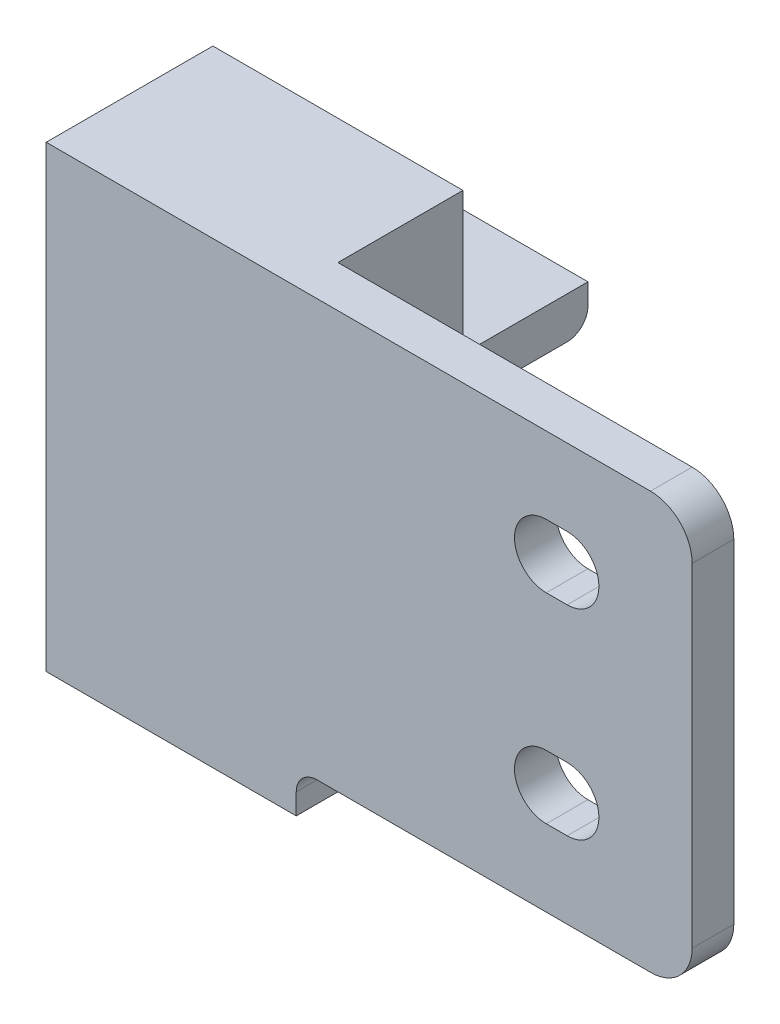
from build123d import *

# Parameters (mm, degrees)
ESQUISSE1_W             = 31
ESQUISSE1_H             = 20
BOSS_EXTRU_1_DEPTH      = 2
BOSS_EXTRU_2_DEPTH      = 6
CONG_2_R                = 2
BOSS_EXTRU_3_DEPTH      = 2
BOSS_EXTRU_3_DEPTH_BACK = 12
ESQUISSE5_W             = 12
ESQUISSE5_H             = 2
CONG_3_R                = 1


with BuildPart() as part:
    # Esquisse1 → Boss.-Extru.1 (new body)
    with BuildSketch(Plane.XY):
        with Locations((-15, 0)):
            Rectangle(ESQUISSE1_W, ESQUISSE1_H)
        with BuildLine():
            Line((-6.5, -3.275), (-5.5, -3.275))
            ThreePointArc((-5.5, -3.275), (-3.975, -4.8), (-5.5, -6.325))
            Line((-5.5, -6.325), (-6.5, -6.325))
            ThreePointArc((-6.5, -6.325), (-8.025, -4.8), (-6.5, -3.275))
        make_face(mode=Mode.SUBTRACT)
        with BuildLine():
            Line((-6.5, 6.325), (-5.5, 6.325))
            ThreePointArc((-5.5, 6.325), (-3.975, 4.8), (-5.5, 3.275))
            Line((-5.5, 3.275), (-6.5, 3.275))
            ThreePointArc((-6.5, 3.275), (-8.025, 4.8), (-6.5, 6.325))
        make_face(mode=Mode.SUBTRACT)
    extrude(amount=BOSS_EXTRU_1_DEPTH)

    # Esquisse3 → Boss.-Extru.2 (add)
    with BuildSketch(Plane.XY):
        Polygon((-30.5, 10), (-20.5, 10), (-18.5, 10), (-18.5, -10), (-20.5, -10), (-30.5, -10), align=None)
    extrude(amount=-BOSS_EXTRU_2_DEPTH)

    # Cong_2
    cong_2_edges = [part.edges().sort_by_distance(p)[0] for p in [
        (0.5, -10, 1),
        (0.5, 10, 1),
    ]]
    fillet(cong_2_edges, radius=CONG_2_R)

    # Esquisse5 → Boss.-Extru.3 (add, two sides: drawn at the far end of the back side and taken through both)
    with BuildSketch(Plane.XY.offset(-BOSS_EXTRU_3_DEPTH_BACK)):
        with Locations((-24.5, -11)):
            Rectangle(ESQUISSE5_W, ESQUISSE5_H)
        with Locations((-24.5, 2.2)):
            Rectangle(ESQUISSE5_W, ESQUISSE5_H)
    extrude(amount=BOSS_EXTRU_3_DEPTH + BOSS_EXTRU_3_DEPTH_BACK)

    # Cong_3
    cong_3_edges = [part.edges().sort_by_distance(p)[0] for p in [
        (-18.5, -10, 1),
        (-24.5, -10, -12),
        (-24.5, 1.2, -12),
    ]]
    fillet(cong_3_edges, radius=CONG_3_R)


solid = part.part
